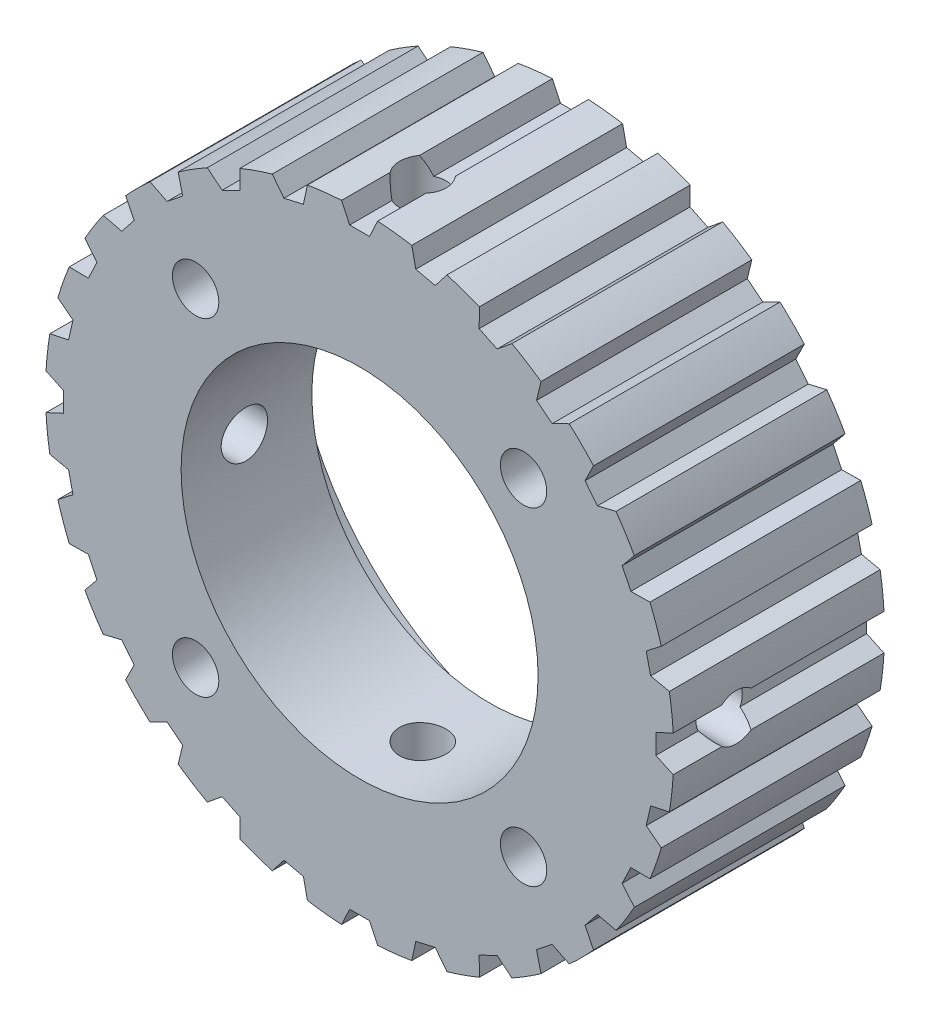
from build123d import *

# Parameters (mm, degrees)
SKETCH1_W                 = 22.35
SKETCH1_H                 = 15
CUT_EXTRUDE1_DEPTH        = 35.986354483
CUT_EXTRUDE2_DEPTH        = 35.986354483
CUT_EXTRUDE3_DEPTH        = 35.986354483
CUT_EXTRUDE4_DEPTH        = 35.986354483
CUT_EXTRUDE5_DEPTH        = 35.986354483
CUT_EXTRUDE6_DEPTH        = 35.986354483
CUT_EXTRUDE7_DEPTH        = 35.986354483
CUT_EXTRUDE8_DEPTH        = 35.986354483
CUT_EXTRUDE9_DEPTH        = 35.986354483
CUT_EXTRUDE10_DEPTH       = 35.986354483
CUT_EXTRUDE11_DEPTH       = 35.986354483
CUT_EXTRUDE12_DEPTH       = 35.986354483
CUT_EXTRUDE13_DEPTH       = 35.986354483
CUT_EXTRUDE14_DEPTH       = 35.986354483
CUT_EXTRUDE15_DEPTH       = 35.986354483
CUT_EXTRUDE16_DEPTH       = 35.986354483
CUT_EXTRUDE17_DEPTH       = 35.986354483
CUT_EXTRUDE18_DEPTH       = 35.986354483
CUT_EXTRUDE19_DEPTH       = 35.986354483
CUT_EXTRUDE20_DEPTH       = 35.986354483
CUT_EXTRUDE21_DEPTH       = 35.962828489
CUT_EXTRUDE22_DEPTH       = 35.962828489
CUT_EXTRUDE23_DEPTH       = 35.962828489
CUT_EXTRUDE24_DEPTH       = 35.962828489
CUT_EXTRUDE25_DEPTH       = 35.962828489
CUT_EXTRUDE26_DEPTH       = 35.962828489
CUT_EXTRUDE27_DEPTH       = 35.962828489
CUT_EXTRUDE28_DEPTH       = 35.939286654
DRAFT1_ANGLE              = 25
DRAFT2_ANGLE              = 25
DRAFT3_ANGLE              = 25
DRAFT4_ANGLE              = 25
DRAFT5_ANGLE              = 25
DRAFT6_ANGLE              = 25
DRAFT7_ANGLE              = 25
DRAFT8_ANGLE              = 25
HOLE1_D                   = 25.4
HOLE1_CBORE_D             = 40
HOLE1_CBORE_DEPTH         = 5.7
F_4_CLEARANCE_HOLE1_D     = 3.3
F_4_CLEARANCE_HOLE1_DEPTH = 9.72079598
F_4_CLEARANCE_HOLE2_D     = 3.3
F_4_CLEARANCE_HOLE2_DEPTH = 9.72079598
F_4_CLEARANCE_HOLE3_D     = 3.3
F_4_CLEARANCE_HOLE3_DEPTH = 9.72079598
F_4_CLEARANCE_HOLE4_D     = 3.3
F_4_CLEARANCE_HOLE4_DEPTH = 9.72079598
F_4_CLEARANCE_HOLE5_D     = 3.3
F_4_CLEARANCE_HOLE5_DEPTH = 15


with BuildPart() as part:
    # Sketch1 → Revolve1 (revolve)
    with BuildSketch(Plane.XZ, mode=Mode.PRIVATE) as revolve1_sk:
        with Locations((11.175, 7.5)):
            Rectangle(SKETCH1_W, SKETCH1_H)
    revolve(revolve1_sk.sketch.rotate(Axis((0, 0, 15), (0, 0, -1)), 180), axis=Axis((0, 0, 15), (0, 0, -1)))

    # Sketch2 → Cut-Extrude1 (cut, through all)
    with BuildSketch(Plane.XY.offset(15)):
        with BuildLine():
            Line((8.525535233, 20.660052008), (8.50857312, 19.299521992))
            Line((8.50857312, 19.299521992), (10.50433369, 19.27464028))
            Line((10.50433369, 19.27464028), (10.837094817, 19.546863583))
            ThreePointArc((10.837094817, 19.546863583), (9.697301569, 20.136654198), (8.525535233, 20.660052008))
        make_face()
    extrude(amount=-CUT_EXTRUDE1_DEPTH, mode=Mode.SUBTRACT)

    # Sketch3 → Cut-Extrude2 (cut, through all)
    with BuildSketch(Plane.XY.offset(15)):
        with BuildLine():
            Line((12.909076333, 18.244951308), (12.589793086, 16.922307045))
            Line((12.589793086, 16.922307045), (13.696536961, 16.039708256))
            Line((13.696536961, 16.039708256), (14.914972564, 16.645302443))
            ThreePointArc((14.914972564, 16.645302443), (13.934997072, 17.473933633), (12.909076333, 18.244951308))
        make_face()
    extrude(amount=-CUT_EXTRUDE2_DEPTH, mode=Mode.SUBTRACT)

    # Sketch4 → Cut-Extrude3 (cut, through all)
    with BuildSketch(Plane.XY.offset(15)):
        with BuildLine():
            Line((16.645302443, 14.914972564), (16.039708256, 13.696536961))
            Line((16.039708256, 13.696536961), (16.922307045, 12.589793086))
            Line((16.922307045, 12.589793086), (18.244951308, 12.909076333))
            ThreePointArc((18.244951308, 12.909076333), (17.473933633, 13.934997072), (16.645302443, 14.914972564))
        make_face()
    extrude(amount=-CUT_EXTRUDE3_DEPTH, mode=Mode.SUBTRACT)

    # Sketch5 → Cut-Extrude4 (cut, through all)
    with BuildSketch(Plane.XY.offset(15)):
        with BuildLine():
            Line((19.546863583, 10.837094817), (19.27464028, 10.50433369))
            Line((19.27464028, 10.50433369), (19.299521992, 8.50857312))
            Line((19.299521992, 8.50857312), (20.660052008, 8.525535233))
            ThreePointArc((20.660052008, 8.525535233), (20.136654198, 9.697301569), (19.546863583, 10.837094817))
        make_face()
    extrude(amount=-CUT_EXTRUDE4_DEPTH, mode=Mode.SUBTRACT)

    # Sketch6 → Cut-Extrude5 (cut, through all)
    with BuildSketch(Plane.XY.offset(15)):
        with BuildLine():
            Line((21.468263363, 6.215799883), (20.393982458, 5.380784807))
            Line((20.393982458, 5.380784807), (20.708978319, 4.000697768))
            Line((20.708978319, 4.000697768), (22.039171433, 3.714488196))
            ThreePointArc((22.039171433, 3.714488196), (21.789638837, 4.973342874), (21.468263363, 6.215799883))
        make_face()
    extrude(amount=-CUT_EXTRUDE5_DEPTH, mode=Mode.SUBTRACT)

    # Sketch7 → Cut-Extrude6 (cut, through all)
    with BuildSketch(Plane.XY.offset(15)):
        with BuildLine():
            Line((22.313154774, 1.282818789), (21.08, 0.707789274))
            Line((21.08, 0.707789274), (21.08, -0.707789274))
            Line((21.08, -0.707789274), (22.313154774, -1.282818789))
            ThreePointArc((22.313154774, -1.282818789), (22.35, 0), (22.313154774, 1.282818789))
        make_face()
    extrude(amount=-CUT_EXTRUDE6_DEPTH, mode=Mode.SUBTRACT)

    # Sketch8 → Cut-Extrude7 (cut, through all)
    with BuildSketch(Plane.XY.offset(15)):
        with BuildLine():
            Line((22.039171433, -3.714488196), (20.708978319, -4.000697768))
            Line((20.708978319, -4.000697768), (20.393982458, -5.380784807))
            Line((20.393982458, -5.380784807), (21.468263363, -6.215799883))
            ThreePointArc((21.468263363, -6.215799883), (21.789638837, -4.973342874), (22.039171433, -3.714488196))
        make_face()
    extrude(amount=-CUT_EXTRUDE7_DEPTH, mode=Mode.SUBTRACT)

    # Sketch9 → Cut-Extrude8 (cut, through all)
    with BuildSketch(Plane.XY.offset(15)):
        with BuildLine():
            Line((20.660052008, -8.525535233), (19.299521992, -8.50857312))
            Line((19.299521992, -8.50857312), (19.27464028, -10.50433369))
            Line((19.27464028, -10.50433369), (19.546863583, -10.837094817))
            ThreePointArc((19.546863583, -10.837094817), (20.136654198, -9.697301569), (20.660052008, -8.525535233))
        make_face()
    extrude(amount=-CUT_EXTRUDE8_DEPTH, mode=Mode.SUBTRACT)

    # Sketch10 → Cut-Extrude9 (cut, through all)
    with BuildSketch(Plane.XY.offset(15)):
        with BuildLine():
            Line((18.244951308, -12.909076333), (16.922307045, -12.589793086))
            Line((16.922307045, -12.589793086), (16.039708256, -13.696536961))
            Line((16.039708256, -13.696536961), (16.645302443, -14.914972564))
            ThreePointArc((16.645302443, -14.914972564), (17.473933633, -13.934997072), (18.244951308, -12.909076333))
        make_face()
    extrude(amount=-CUT_EXTRUDE9_DEPTH, mode=Mode.SUBTRACT)

    # Sketch11 → Cut-Extrude10 (cut, through all)
    with BuildSketch(Plane.XY.offset(15)):
        with BuildLine():
            Line((14.914972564, -16.645302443), (13.696536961, -16.039708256))
            Line((13.696536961, -16.039708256), (12.589793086, -16.922307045))
            Line((12.589793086, -16.922307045), (12.909076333, -18.244951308))
            ThreePointArc((12.909076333, -18.244951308), (13.934997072, -17.473933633), (14.914972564, -16.645302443))
        make_face()
    extrude(amount=-CUT_EXTRUDE10_DEPTH, mode=Mode.SUBTRACT)

    # Sketch12 → Cut-Extrude11 (cut, through all)
    with BuildSketch(Plane.XY.offset(15)):
        with BuildLine():
            Line((10.837094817, -19.546863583), (10.50433369, -19.27464028))
            Line((10.50433369, -19.27464028), (8.50857312, -19.299521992))
            Line((8.50857312, -19.299521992), (8.525535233, -20.660052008))
            ThreePointArc((8.525535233, -20.660052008), (9.697301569, -20.136654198), (10.837094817, -19.546863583))
        make_face()
    extrude(amount=-CUT_EXTRUDE11_DEPTH, mode=Mode.SUBTRACT)

    # Sketch13 → Cut-Extrude12 (cut, through all)
    with BuildSketch(Plane.XY.offset(15)):
        with BuildLine():
            Line((6.215799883, -21.468263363), (5.380784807, -20.393982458))
            Line((5.380784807, -20.393982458), (4.000697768, -20.708978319))
            Line((4.000697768, -20.708978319), (3.714488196, -22.039171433))
            ThreePointArc((3.714488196, -22.039171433), (4.973342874, -21.789638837), (6.215799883, -21.468263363))
        make_face()
    extrude(amount=-CUT_EXTRUDE12_DEPTH, mode=Mode.SUBTRACT)

    # Sketch14 → Cut-Extrude13 (cut, through all)
    with BuildSketch(Plane.XY.offset(15)):
        with BuildLine():
            Line((1.282818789, -22.313154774), (0.707789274, -21.08))
            Line((0.707789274, -21.08), (-0.707789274, -21.08))
            Line((-0.707789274, -21.08), (-1.282818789, -22.313154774))
            ThreePointArc((-1.282818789, -22.313154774), (0, -22.35), (1.282818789, -22.313154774))
        make_face()
    extrude(amount=-CUT_EXTRUDE13_DEPTH, mode=Mode.SUBTRACT)

    # Sketch15 → Cut-Extrude14 (cut, through all)
    with BuildSketch(Plane.XY.offset(15)):
        with BuildLine():
            Line((-3.714488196, -22.039171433), (-4.000697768, -20.708978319))
            Line((-4.000697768, -20.708978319), (-5.380784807, -20.393982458))
            Line((-5.380784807, -20.393982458), (-6.215799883, -21.468263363))
            ThreePointArc((-6.215799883, -21.468263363), (-4.973342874, -21.789638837), (-3.714488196, -22.039171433))
        make_face()
    extrude(amount=-CUT_EXTRUDE14_DEPTH, mode=Mode.SUBTRACT)

    # Sketch16 → Cut-Extrude15 (cut, through all)
    with BuildSketch(Plane.XY.offset(15)):
        with BuildLine():
            Line((-8.525535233, -20.660052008), (-8.50857312, -19.299521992))
            Line((-8.50857312, -19.299521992), (-10.50433369, -19.27464028))
            Line((-10.50433369, -19.27464028), (-10.837094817, -19.546863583))
            ThreePointArc((-10.837094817, -19.546863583), (-9.697301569, -20.136654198), (-8.525535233, -20.660052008))
        make_face()
    extrude(amount=-CUT_EXTRUDE15_DEPTH, mode=Mode.SUBTRACT)

    # Sketch17 → Cut-Extrude16 (cut, through all)
    with BuildSketch(Plane.XY.offset(15)):
        with BuildLine():
            Line((-12.909076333, -18.244951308), (-12.589793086, -16.922307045))
            Line((-12.589793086, -16.922307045), (-13.696536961, -16.039708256))
            Line((-13.696536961, -16.039708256), (-14.914972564, -16.645302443))
            ThreePointArc((-14.914972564, -16.645302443), (-13.934997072, -17.473933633), (-12.909076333, -18.244951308))
        make_face()
    extrude(amount=-CUT_EXTRUDE16_DEPTH, mode=Mode.SUBTRACT)

    # Sketch18 → Cut-Extrude17 (cut, through all)
    with BuildSketch(Plane.XY.offset(15)):
        with BuildLine():
            Line((-16.645302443, -14.914972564), (-16.039708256, -13.696536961))
            Line((-16.039708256, -13.696536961), (-16.922307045, -12.589793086))
            Line((-16.922307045, -12.589793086), (-18.244951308, -12.909076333))
            ThreePointArc((-18.244951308, -12.909076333), (-17.473933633, -13.934997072), (-16.645302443, -14.914972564))
        make_face()
    extrude(amount=-CUT_EXTRUDE17_DEPTH, mode=Mode.SUBTRACT)

    # Sketch19 → Cut-Extrude18 (cut, through all)
    with BuildSketch(Plane.XY.offset(15)):
        with BuildLine():
            Line((-19.546863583, -10.837094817), (-19.27464028, -10.50433369))
            Line((-19.27464028, -10.50433369), (-19.299521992, -8.50857312))
            Line((-19.299521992, -8.50857312), (-20.660052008, -8.525535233))
            ThreePointArc((-20.660052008, -8.525535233), (-20.136654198, -9.697301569), (-19.546863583, -10.837094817))
        make_face()
    extrude(amount=-CUT_EXTRUDE18_DEPTH, mode=Mode.SUBTRACT)

    # Sketch20 → Cut-Extrude19 (cut, through all)
    with BuildSketch(Plane.XY.offset(15)):
        with BuildLine():
            Line((-21.468263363, -6.215799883), (-20.393982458, -5.380784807))
            Line((-20.393982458, -5.380784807), (-20.708978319, -4.000697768))
            Line((-20.708978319, -4.000697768), (-22.039171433, -3.714488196))
            ThreePointArc((-22.039171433, -3.714488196), (-21.789638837, -4.973342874), (-21.468263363, -6.215799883))
        make_face()
    extrude(amount=-CUT_EXTRUDE19_DEPTH, mode=Mode.SUBTRACT)

    # Sketch21 → Cut-Extrude20 (cut, through all)
    with BuildSketch(Plane.XY.offset(15)):
        with BuildLine():
            Line((-22.313154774, -1.282818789), (-21.08, -0.707789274))
            Line((-21.08, -0.707789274), (-21.08, 0.707789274))
            Line((-21.08, 0.707789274), (-22.313154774, 1.282818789))
            ThreePointArc((-22.313154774, 1.282818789), (-22.35, 0), (-22.313154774, -1.282818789))
        make_face()
    extrude(amount=-CUT_EXTRUDE20_DEPTH, mode=Mode.SUBTRACT)

    # Sketch22 → Cut-Extrude21 (cut, through all)
    with BuildSketch(Plane.XY.offset(15)):
        with BuildLine():
            Line((-22.039171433, 3.714488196), (-20.708978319, 4.000697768))
            Line((-20.708978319, 4.000697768), (-20.393982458, 5.380784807))
            Line((-20.393982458, 5.380784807), (-21.468263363, 6.215799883))
            ThreePointArc((-21.468263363, 6.215799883), (-21.789638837, 4.973342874), (-22.039171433, 3.714488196))
        make_face()
    extrude(amount=-CUT_EXTRUDE21_DEPTH, mode=Mode.SUBTRACT)

    # Sketch23 → Cut-Extrude22 (cut, through all)
    with BuildSketch(Plane.XY.offset(15)):
        with BuildLine():
            Line((-20.660052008, 8.525535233), (-19.299521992, 8.50857312))
            Line((-19.299521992, 8.50857312), (-19.27464028, 10.50433369))
            Line((-19.27464028, 10.50433369), (-19.546863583, 10.837094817))
            ThreePointArc((-19.546863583, 10.837094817), (-20.136654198, 9.697301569), (-20.660052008, 8.525535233))
        make_face()
    extrude(amount=-CUT_EXTRUDE22_DEPTH, mode=Mode.SUBTRACT)

    # Sketch24 → Cut-Extrude23 (cut, through all)
    with BuildSketch(Plane.XY.offset(15)):
        with BuildLine():
            Line((-18.244951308, 12.909076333), (-16.922307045, 12.589793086))
            Line((-16.922307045, 12.589793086), (-16.039708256, 13.696536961))
            Line((-16.039708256, 13.696536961), (-16.645302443, 14.914972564))
            ThreePointArc((-16.645302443, 14.914972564), (-17.473933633, 13.934997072), (-18.244951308, 12.909076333))
        make_face()
    extrude(amount=-CUT_EXTRUDE23_DEPTH, mode=Mode.SUBTRACT)

    # Sketch25 → Cut-Extrude24 (cut, through all)
    with BuildSketch(Plane.XY.offset(15)):
        with BuildLine():
            Line((-14.914972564, 16.645302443), (-13.696536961, 16.039708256))
            Line((-13.696536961, 16.039708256), (-12.589793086, 16.922307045))
            Line((-12.589793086, 16.922307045), (-12.909076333, 18.244951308))
            ThreePointArc((-12.909076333, 18.244951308), (-13.934997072, 17.473933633), (-14.914972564, 16.645302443))
        make_face()
    extrude(amount=-CUT_EXTRUDE24_DEPTH, mode=Mode.SUBTRACT)

    # Sketch26 → Cut-Extrude25 (cut, through all)
    with BuildSketch(Plane.XY.offset(15)):
        with BuildLine():
            Line((-10.837094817, 19.546863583), (-10.50433369, 19.27464028))
            Line((-10.50433369, 19.27464028), (-8.50857312, 19.299521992))
            Line((-8.50857312, 19.299521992), (-8.525535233, 20.660052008))
            ThreePointArc((-8.525535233, 20.660052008), (-9.697301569, 20.136654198), (-10.837094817, 19.546863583))
        make_face()
    extrude(amount=-CUT_EXTRUDE25_DEPTH, mode=Mode.SUBTRACT)

    # Sketch27 → Cut-Extrude26 (cut, through all)
    with BuildSketch(Plane.XY.offset(15)):
        with BuildLine():
            Line((-6.215799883, 21.468263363), (-5.380784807, 20.393982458))
            Line((-5.380784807, 20.393982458), (-4.000697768, 20.708978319))
            Line((-4.000697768, 20.708978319), (-3.714488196, 22.039171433))
            ThreePointArc((-3.714488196, 22.039171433), (-4.973342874, 21.789638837), (-6.215799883, 21.468263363))
        make_face()
    extrude(amount=-CUT_EXTRUDE26_DEPTH, mode=Mode.SUBTRACT)

    # Sketch28 → Cut-Extrude27 (cut, through all)
    with BuildSketch(Plane.XY.offset(15)):
        with BuildLine():
            Line((-1.282818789, 22.313154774), (-0.707789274, 21.08))
            Line((-0.707789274, 21.08), (0.707789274, 21.08))
            Line((0.707789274, 21.08), (1.282818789, 22.313154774))
            ThreePointArc((1.282818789, 22.313154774), (0, 22.35), (-1.282818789, 22.313154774))
        make_face()
    extrude(amount=-CUT_EXTRUDE27_DEPTH, mode=Mode.SUBTRACT)

    # Sketch29 → Cut-Extrude28 (cut, through all)
    with BuildSketch(Plane.XY.offset(15)):
        with BuildLine():
            Line((3.714488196, 22.039171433), (4.000697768, 20.708978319))
            Line((4.000697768, 20.708978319), (5.380784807, 20.393982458))
            Line((5.380784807, 20.393982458), (6.215799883, 21.468263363))
            ThreePointArc((6.215799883, 21.468263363), (4.973342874, 21.789638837), (3.714488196, 22.039171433))
        make_face()
    extrude(amount=-CUT_EXTRUDE28_DEPTH, mode=Mode.SUBTRACT)

    # Draft1
    draft1_faces = [part.faces().sort_by_distance(p)[0] for p in [
        (9.506453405, 19.287081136, 7.5),
    ]]
    draft(draft1_faces, Plane(origin=(8.525535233, 20.660052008, 0), x_dir=(0.012466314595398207, 0.9999222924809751, 0), z_dir=(0.9999222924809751, -0.012466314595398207, 0)), DRAFT1_ANGLE)

    # Draft2
    draft2_faces = [part.faces().sort_by_distance(p)[0] for p in [
        (19.287081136, 9.506453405, 7.5),
    ]]
    draft(draft2_faces, Plane(origin=(19.299521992, 8.50857312, 0), x_dir=(0.9999222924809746, 0.012466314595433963, 0), z_dir=(-0.012466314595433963, 0.9999222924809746, 0)), DRAFT2_ANGLE)

    # Draft3
    draft3_faces = [part.faces().sort_by_distance(p)[0] for p in [
        (19.287081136, -9.506453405, 7.5),
    ]]
    draft(draft3_faces, Plane(origin=(20.660052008, -8.525535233, 0), x_dir=(-0.999922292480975, 0.012466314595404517, 0), z_dir=(-0.012466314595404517, -0.999922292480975, 0)), DRAFT3_ANGLE)

    # Draft4
    draft4_faces = [part.faces().sort_by_distance(p)[0] for p in [
        (9.506453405, -19.287081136, 7.5),
    ]]
    draft(draft4_faces, Plane(origin=(8.50857312, -19.299521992, 0), x_dir=(-0.012466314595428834, 0.9999222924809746, 0), z_dir=(0.9999222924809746, 0.012466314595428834, 0)), DRAFT4_ANGLE)

    # Draft5
    draft5_faces = [part.faces().sort_by_distance(p)[0] for p in [
        (-9.506453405, -19.287081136, 7.5),
    ]]
    draft(draft5_faces, Plane(origin=(-8.525535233, -20.660052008, 0), x_dir=(-0.012466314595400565, -0.999922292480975, 0), z_dir=(-0.999922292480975, 0.012466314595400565, 0)), DRAFT5_ANGLE)

    # Draft6
    draft6_faces = [part.faces().sort_by_distance(p)[0] for p in [
        (-19.287081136, -9.506453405, 7.5),
    ]]
    draft(draft6_faces, Plane(origin=(-19.299521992, -8.50857312, 0), x_dir=(-0.9999222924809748, -0.012466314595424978, 0), z_dir=(0.012466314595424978, -0.9999222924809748, 0)), DRAFT6_ANGLE)

    # Draft7
    draft7_faces = [part.faces().sort_by_distance(p)[0] for p in [
        (-19.287081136, 9.506453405, 7.5),
    ]]
    draft(draft7_faces, Plane(origin=(-20.660052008, 8.525535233, 0), x_dir=(0.9999222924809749, -0.012466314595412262, 0), z_dir=(0.012466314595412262, 0.9999222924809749, 0)), DRAFT7_ANGLE)

    # Draft8
    draft8_faces = [part.faces().sort_by_distance(p)[0] for p in [
        (-9.506453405, 19.287081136, 7.5),
    ]]
    draft(draft8_faces, Plane(origin=(-8.50857312, 19.299521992, 0), x_dir=(0.01246631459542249, -0.9999222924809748, 0), z_dir=(-0.9999222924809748, -0.01246631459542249, 0)), DRAFT8_ANGLE)

    # Hole1 (through all)
    with Locations(Plane(origin=(0, 0, 0), x_dir=(-1, 0, 0), z_dir=(0, 0, -1))):
        with Locations((0, 0)):
            CounterBoreHole(HOLE1_D / 2, HOLE1_CBORE_D / 2, HOLE1_CBORE_DEPTH)

    # 4 Clearance Hole1
    with Locations(Plane.ZY.offset(-12.592358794)):
        with Locations((10.5, 0)):
            Hole(F_4_CLEARANCE_HOLE1_D / 2, depth=F_4_CLEARANCE_HOLE1_DEPTH)

    # 4 Clearance Hole2
    with Locations(Plane(origin=(0, -12.592358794, 0), x_dir=(1, 0, 0), z_dir=(0, 1, 0))):
        with Locations((0, -10.5)):
            Hole(F_4_CLEARANCE_HOLE2_D / 2, depth=F_4_CLEARANCE_HOLE2_DEPTH)

    # 4 Clearance Hole3
    with Locations(Plane(origin=(-12.592358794, 0, 0), x_dir=(0, 0, -1), z_dir=(1, 0, 0))):
        with Locations((-10.5, 0)):
            Hole(F_4_CLEARANCE_HOLE3_D / 2, depth=F_4_CLEARANCE_HOLE3_DEPTH)

    # 4 Clearance Hole4
    with Locations(Plane(origin=(0, 12.592358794, 0), x_dir=(-1, 0, 0), z_dir=(0, -1, 0))):
        with Locations((0, -10.5)):
            Hole(F_4_CLEARANCE_HOLE4_D / 2, depth=F_4_CLEARANCE_HOLE4_DEPTH)

    # 4 Clearance Hole5
    with Locations(Plane.XY.offset(15)):
        with Locations((11.66726189, -11.66726189), (-11.66726189, -11.66726189), (-11.66726189, 11.66726189), (11.66726189, 11.66726189)):
            Hole(F_4_CLEARANCE_HOLE5_D / 2, depth=F_4_CLEARANCE_HOLE5_DEPTH)


solid = part.part
